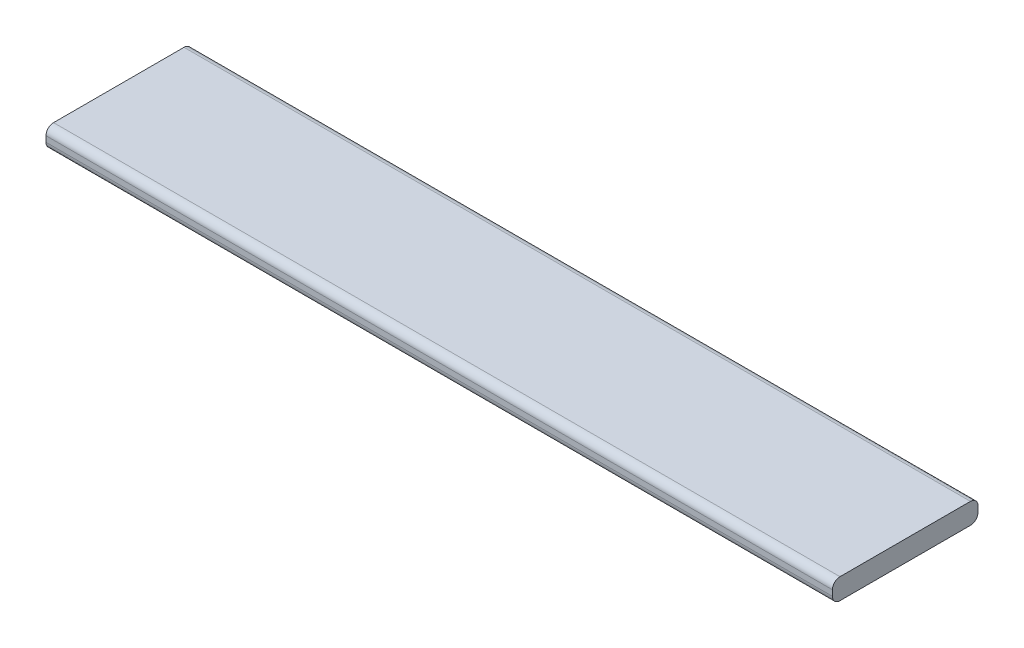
ISO-10303-21;
HEADER;
FILE_DESCRIPTION(('STEP AP214'),'2;1');
FILE_NAME('part.step','',(''),(''),'','','');
FILE_SCHEMA(('AUTOMOTIVE_DESIGN { 1 0 10303 214 1 1 1 1 }'));
ENDSEC;
DATA;
#1=APPLICATION_CONTEXT('core data for automotive mechanical design processes');
#2=APPLICATION_PROTOCOL_DEFINITION('international standard','automotive_design',2000,#1);
#3=PRODUCT_CONTEXT('',#1,'mechanical');
#4=PRODUCT('Part','Part','',(#3));
#5=PRODUCT_RELATED_PRODUCT_CATEGORY('part','',(#4));
#6=PRODUCT_DEFINITION_FORMATION('','',#4);
#7=PRODUCT_DEFINITION_CONTEXT('part definition',#1,'design');
#8=PRODUCT_DEFINITION('design','',#6,#7);
#9=PRODUCT_DEFINITION_SHAPE('','',#8);
#10=(LENGTH_UNIT() NAMED_UNIT(*) SI_UNIT(.MILLI.,.METRE.));
#11=(NAMED_UNIT(*) PLANE_ANGLE_UNIT() SI_UNIT($,.RADIAN.));
#12=(NAMED_UNIT(*) SI_UNIT($,.STERADIAN.) SOLID_ANGLE_UNIT());
#13=UNCERTAINTY_MEASURE_WITH_UNIT(LENGTH_MEASURE(1.E-05),#10,'distance_accuracy_value','');
#14=(GEOMETRIC_REPRESENTATION_CONTEXT(3) GLOBAL_UNCERTAINTY_ASSIGNED_CONTEXT((#13)) GLOBAL_UNIT_ASSIGNED_CONTEXT((#10,
#11,#12)) REPRESENTATION_CONTEXT('',''));
#15=CARTESIAN_POINT('',(0.,0.,0.));
#16=DIRECTION('',(0.,0.,1.));
#17=DIRECTION('',(1.,0.,0.));
#18=AXIS2_PLACEMENT_3D('',#15,#16,#17);
#19=CARTESIAN_POINT('',(783.878521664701,0.,0.));
#20=DIRECTION('',(0.,0.,1.));
#21=DIRECTION('',(1.,0.,0.));
#22=AXIS2_PLACEMENT_3D('',#19,#20,#21);
#23=PLANE('',#22);
#24=DIRECTION('',(0.,1.,0.));
#25=VECTOR('',#24,1.);
#26=CARTESIAN_POINT('',(0.,0.,0.));
#27=LINE('',#26,#25);
#28=CARTESIAN_POINT('',(0.,6.35,0.));
#29=VERTEX_POINT('',#28);
#30=CARTESIAN_POINT('',(0.,11.1125,0.));
#31=VERTEX_POINT('',#30);
#32=EDGE_CURVE('E175',#29,#31,#27,.T.);
#33=ORIENTED_EDGE('',*,*,#32,.T.);
#34=DIRECTION('',(-1.,0.,0.));
#35=VECTOR('',#34,1.);
#36=CARTESIAN_POINT('',(783.878521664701,11.1125,0.));
#37=LINE('',#36,#35);
#38=CARTESIAN_POINT('',(660.4,11.1125,0.));
#39=VERTEX_POINT('',#38);
#40=EDGE_CURVE('E56',#31,#39,#37,.F.);
#41=ORIENTED_EDGE('',*,*,#40,.T.);
#42=DIRECTION('',(0.,1.,0.));
#43=VECTOR('',#42,1.);
#44=CARTESIAN_POINT('',(660.4,0.,0.));
#45=LINE('',#44,#43);
#46=CARTESIAN_POINT('',(660.4,6.35,0.));
#47=VERTEX_POINT('',#46);
#48=EDGE_CURVE('E169',#47,#39,#45,.T.);
#49=ORIENTED_EDGE('',*,*,#48,.F.);
#50=DIRECTION('',(-1.,0.,0.));
#51=VECTOR('',#50,1.);
#52=CARTESIAN_POINT('',(783.878521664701,6.35,0.));
#53=LINE('',#52,#51);
#54=EDGE_CURVE('E117',#47,#29,#53,.T.);
#55=ORIENTED_EDGE('',*,*,#54,.T.);
#56=EDGE_LOOP('',(#33,#41,#49,#55));
#57=FACE_BOUND('',#56,.T.);
#58=ADVANCED_FACE('F41',(#57),#23,.F.);
#59=CARTESIAN_POINT('',(783.878521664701,17.4625,0.));
#60=DIRECTION('',(0.,-1.,0.));
#61=DIRECTION('',(0.,0.,-1.));
#62=AXIS2_PLACEMENT_3D('',#59,#60,#61);
#63=PLANE('',#62);
#64=DIRECTION('',(0.,0.,1.));
#65=VECTOR('',#64,1.);
#66=CARTESIAN_POINT('',(0.,17.4625,0.));
#67=LINE('',#66,#65);
#68=CARTESIAN_POINT('',(0.,17.4625,6.35));
#69=VERTEX_POINT('',#68);
#70=CARTESIAN_POINT('',(0.,17.4625,115.8875));
#71=VERTEX_POINT('',#70);
#72=EDGE_CURVE('E170',#69,#71,#67,.T.);
#73=ORIENTED_EDGE('',*,*,#72,.T.);
#74=DIRECTION('',(-1.,0.,0.));
#75=VECTOR('',#74,1.);
#76=CARTESIAN_POINT('',(783.878521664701,17.4625,115.8875));
#77=LINE('',#76,#75);
#78=CARTESIAN_POINT('',(660.4,17.4625,115.8875));
#79=VERTEX_POINT('',#78);
#80=EDGE_CURVE('E145',#71,#79,#77,.F.);
#81=ORIENTED_EDGE('',*,*,#80,.T.);
#82=DIRECTION('',(0.,0.,1.));
#83=VECTOR('',#82,1.);
#84=CARTESIAN_POINT('',(660.4,17.4625,0.));
#85=LINE('',#84,#83);
#86=CARTESIAN_POINT('',(660.4,17.4625,6.35));
#87=VERTEX_POINT('',#86);
#88=EDGE_CURVE('E113',#87,#79,#85,.T.);
#89=ORIENTED_EDGE('',*,*,#88,.F.);
#90=DIRECTION('',(-1.,0.,0.));
#91=VECTOR('',#90,1.);
#92=CARTESIAN_POINT('',(783.878521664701,17.4625,6.35));
#93=LINE('',#92,#91);
#94=EDGE_CURVE('E142',#87,#69,#93,.T.);
#95=ORIENTED_EDGE('',*,*,#94,.T.);
#96=EDGE_LOOP('',(#73,#81,#89,#95));
#97=FACE_BOUND('',#96,.T.);
#98=ADVANCED_FACE('F185',(#97),#63,.F.);
#99=CARTESIAN_POINT('',(783.878521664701,0.,122.2375));
#100=DIRECTION('',(0.,0.,-1.));
#101=DIRECTION('',(-1.,0.,0.));
#102=AXIS2_PLACEMENT_3D('',#99,#100,#101);
#103=PLANE('',#102);
#104=DIRECTION('',(0.,-1.,0.));
#105=VECTOR('',#104,1.);
#106=CARTESIAN_POINT('',(660.4,0.,122.2375));
#107=LINE('',#106,#105);
#108=CARTESIAN_POINT('',(660.4,11.1125,122.2375));
#109=VERTEX_POINT('',#108);
#110=CARTESIAN_POINT('',(660.4,6.34999999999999,122.2375));
#111=VERTEX_POINT('',#110);
#112=EDGE_CURVE('E110',#109,#111,#107,.T.);
#113=ORIENTED_EDGE('',*,*,#112,.F.);
#114=DIRECTION('',(-1.,0.,0.));
#115=VECTOR('',#114,1.);
#116=CARTESIAN_POINT('',(783.878521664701,11.1125,122.2375));
#117=LINE('',#116,#115);
#118=CARTESIAN_POINT('',(0.,11.1125,122.2375));
#119=VERTEX_POINT('',#118);
#120=EDGE_CURVE('E124',#109,#119,#117,.T.);
#121=ORIENTED_EDGE('',*,*,#120,.T.);
#122=DIRECTION('',(0.,-1.,0.));
#123=VECTOR('',#122,1.);
#124=CARTESIAN_POINT('',(0.,0.,122.2375));
#125=LINE('',#124,#123);
#126=CARTESIAN_POINT('',(0.,6.34999999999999,122.2375));
#127=VERTEX_POINT('',#126);
#128=EDGE_CURVE('E167',#119,#127,#125,.T.);
#129=ORIENTED_EDGE('',*,*,#128,.T.);
#130=DIRECTION('',(-1.,0.,0.));
#131=VECTOR('',#130,1.);
#132=CARTESIAN_POINT('',(783.878521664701,6.34999999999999,122.2375));
#133=LINE('',#132,#131);
#134=EDGE_CURVE('E127',#127,#111,#133,.F.);
#135=ORIENTED_EDGE('',*,*,#134,.T.);
#136=EDGE_LOOP('',(#113,#121,#129,#135));
#137=FACE_BOUND('',#136,.T.);
#138=ADVANCED_FACE('F122',(#137),#103,.F.);
#139=CARTESIAN_POINT('',(783.878521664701,0.,0.));
#140=DIRECTION('',(0.,1.,0.));
#141=DIRECTION('',(0.,0.,1.));
#142=AXIS2_PLACEMENT_3D('',#139,#140,#141);
#143=PLANE('',#142);
#144=DIRECTION('',(0.,0.,-1.));
#145=VECTOR('',#144,1.);
#146=CARTESIAN_POINT('',(0.,0.,0.));
#147=LINE('',#146,#145);
#148=CARTESIAN_POINT('',(0.,0.,115.8875));
#149=VERTEX_POINT('',#148);
#150=CARTESIAN_POINT('',(0.,0.,6.35));
#151=VERTEX_POINT('',#150);
#152=EDGE_CURVE('E160',#149,#151,#147,.T.);
#153=ORIENTED_EDGE('',*,*,#152,.T.);
#154=DIRECTION('',(-1.,0.,0.));
#155=VECTOR('',#154,1.);
#156=CARTESIAN_POINT('',(783.878521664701,0.,6.35));
#157=LINE('',#156,#155);
#158=CARTESIAN_POINT('',(660.4,0.,6.35));
#159=VERTEX_POINT('',#158);
#160=EDGE_CURVE('E11',#151,#159,#157,.F.);
#161=ORIENTED_EDGE('',*,*,#160,.T.);
#162=DIRECTION('',(0.,0.,-1.));
#163=VECTOR('',#162,1.);
#164=CARTESIAN_POINT('',(660.4,0.,0.));
#165=LINE('',#164,#163);
#166=CARTESIAN_POINT('',(660.4,0.,115.8875));
#167=VERTEX_POINT('',#166);
#168=EDGE_CURVE('E162',#167,#159,#165,.T.);
#169=ORIENTED_EDGE('',*,*,#168,.F.);
#170=DIRECTION('',(-1.,0.,0.));
#171=VECTOR('',#170,1.);
#172=CARTESIAN_POINT('',(783.878521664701,0.,115.8875));
#173=LINE('',#172,#171);
#174=EDGE_CURVE('E49',#167,#149,#173,.T.);
#175=ORIENTED_EDGE('',*,*,#174,.T.);
#176=EDGE_LOOP('',(#153,#161,#169,#175));
#177=FACE_BOUND('',#176,.T.);
#178=ADVANCED_FACE('F159',(#177),#143,.F.);
#179=CARTESIAN_POINT('',(0.,0.,0.));
#180=DIRECTION('',(1.,0.,0.));
#181=DIRECTION('',(0.,0.,-1.));
#182=AXIS2_PLACEMENT_3D('',#179,#180,#181);
#183=PLANE('',#182);
#184=ORIENTED_EDGE('',*,*,#128,.F.);
#185=CARTESIAN_POINT('',(0.,11.1125,115.8875));
#186=DIRECTION('',(1.,0.,0.));
#187=DIRECTION('',(0.,0.,-1.));
#188=AXIS2_PLACEMENT_3D('',#185,#186,#187);
#189=CIRCLE('',#188,6.35);
#190=EDGE_CURVE('E130',#119,#71,#189,.F.);
#191=ORIENTED_EDGE('',*,*,#190,.T.);
#192=ORIENTED_EDGE('',*,*,#72,.F.);
#193=CARTESIAN_POINT('',(0.,11.1125,6.35));
#194=DIRECTION('',(1.,0.,0.));
#195=DIRECTION('',(0.,0.,-1.));
#196=AXIS2_PLACEMENT_3D('',#193,#194,#195);
#197=CIRCLE('',#196,6.35);
#198=EDGE_CURVE('E139',#69,#31,#197,.F.);
#199=ORIENTED_EDGE('',*,*,#198,.T.);
#200=ORIENTED_EDGE('',*,*,#32,.F.);
#201=CARTESIAN_POINT('',(0.,6.35,6.35));
#202=DIRECTION('',(1.,0.,0.));
#203=DIRECTION('',(0.,0.,-1.));
#204=AXIS2_PLACEMENT_3D('',#201,#202,#203);
#205=CIRCLE('',#204,6.35);
#206=EDGE_CURVE('E133',#29,#151,#205,.F.);
#207=ORIENTED_EDGE('',*,*,#206,.T.);
#208=ORIENTED_EDGE('',*,*,#152,.F.);
#209=CARTESIAN_POINT('',(0.,6.34999999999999,115.8875));
#210=DIRECTION('',(1.,0.,0.));
#211=DIRECTION('',(0.,0.,-1.));
#212=AXIS2_PLACEMENT_3D('',#209,#210,#211);
#213=CIRCLE('',#212,6.35);
#214=EDGE_CURVE('E131',#149,#127,#213,.F.);
#215=ORIENTED_EDGE('',*,*,#214,.T.);
#216=EDGE_LOOP('',(#184,#191,#192,#199,#200,#207,#208,#215));
#217=FACE_BOUND('',#216,.T.);
#218=ADVANCED_FACE('F165',(#217),#183,.F.);
#219=CARTESIAN_POINT('',(660.4,0.,0.));
#220=DIRECTION('',(1.,0.,0.));
#221=DIRECTION('',(0.,0.,-1.));
#222=AXIS2_PLACEMENT_3D('',#219,#220,#221);
#223=PLANE('',#222);
#224=ORIENTED_EDGE('',*,*,#88,.T.);
#225=CARTESIAN_POINT('',(660.4,11.1125,115.8875));
#226=DIRECTION('',(1.,0.,0.));
#227=DIRECTION('',(0.,0.,-1.));
#228=AXIS2_PLACEMENT_3D('',#225,#226,#227);
#229=CIRCLE('',#228,6.35);
#230=EDGE_CURVE('E107',#79,#109,#229,.T.);
#231=ORIENTED_EDGE('',*,*,#230,.T.);
#232=ORIENTED_EDGE('',*,*,#112,.T.);
#233=CARTESIAN_POINT('',(660.4,6.34999999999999,115.8875));
#234=DIRECTION('',(1.,0.,0.));
#235=DIRECTION('',(0.,0.,-1.));
#236=AXIS2_PLACEMENT_3D('',#233,#234,#235);
#237=CIRCLE('',#236,6.35);
#238=EDGE_CURVE('E147',#111,#167,#237,.T.);
#239=ORIENTED_EDGE('',*,*,#238,.T.);
#240=ORIENTED_EDGE('',*,*,#168,.T.);
#241=CARTESIAN_POINT('',(660.4,6.35,6.35));
#242=DIRECTION('',(1.,0.,0.));
#243=DIRECTION('',(0.,0.,-1.));
#244=AXIS2_PLACEMENT_3D('',#241,#242,#243);
#245=CIRCLE('',#244,6.35);
#246=EDGE_CURVE('E63',#159,#47,#245,.T.);
#247=ORIENTED_EDGE('',*,*,#246,.T.);
#248=ORIENTED_EDGE('',*,*,#48,.T.);
#249=CARTESIAN_POINT('',(660.4,11.1125,6.35));
#250=DIRECTION('',(1.,0.,0.));
#251=DIRECTION('',(0.,0.,-1.));
#252=AXIS2_PLACEMENT_3D('',#249,#250,#251);
#253=CIRCLE('',#252,6.35);
#254=EDGE_CURVE('E118',#39,#87,#253,.T.);
#255=ORIENTED_EDGE('',*,*,#254,.T.);
#256=EDGE_LOOP('',(#224,#231,#232,#239,#240,#247,#248,#255));
#257=FACE_BOUND('',#256,.T.);
#258=ADVANCED_FACE('F109',(#257),#223,.T.);
#259=CARTESIAN_POINT('',(783.878521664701,11.1125,115.8875));
#260=DIRECTION('',(-1.,0.,0.));
#261=DIRECTION('',(0.,0.,1.));
#262=AXIS2_PLACEMENT_3D('',#259,#260,#261);
#263=CYLINDRICAL_SURFACE('',#262,6.35);
#264=ORIENTED_EDGE('',*,*,#230,.F.);
#265=ORIENTED_EDGE('',*,*,#80,.F.);
#266=ORIENTED_EDGE('',*,*,#190,.F.);
#267=ORIENTED_EDGE('',*,*,#120,.F.);
#268=EDGE_LOOP('',(#264,#265,#266,#267));
#269=FACE_BOUND('',#268,.T.);
#270=ADVANCED_FACE('F129',(#269),#263,.T.);
#271=CARTESIAN_POINT('',(783.878521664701,11.1125,6.35));
#272=DIRECTION('',(-1.,0.,0.));
#273=DIRECTION('',(0.,0.,1.));
#274=AXIS2_PLACEMENT_3D('',#271,#272,#273);
#275=CYLINDRICAL_SURFACE('',#274,6.35);
#276=ORIENTED_EDGE('',*,*,#254,.F.);
#277=ORIENTED_EDGE('',*,*,#40,.F.);
#278=ORIENTED_EDGE('',*,*,#198,.F.);
#279=ORIENTED_EDGE('',*,*,#94,.F.);
#280=EDGE_LOOP('',(#276,#277,#278,#279));
#281=FACE_BOUND('',#280,.T.);
#282=ADVANCED_FACE('F182',(#281),#275,.T.);
#283=CARTESIAN_POINT('',(783.878521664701,6.35,6.35));
#284=DIRECTION('',(-1.,0.,0.));
#285=DIRECTION('',(0.,0.,1.));
#286=AXIS2_PLACEMENT_3D('',#283,#284,#285);
#287=CYLINDRICAL_SURFACE('',#286,6.35);
#288=ORIENTED_EDGE('',*,*,#246,.F.);
#289=ORIENTED_EDGE('',*,*,#160,.F.);
#290=ORIENTED_EDGE('',*,*,#206,.F.);
#291=ORIENTED_EDGE('',*,*,#54,.F.);
#292=EDGE_LOOP('',(#288,#289,#290,#291));
#293=FACE_BOUND('',#292,.T.);
#294=ADVANCED_FACE('F187',(#293),#287,.T.);
#295=CARTESIAN_POINT('',(783.878521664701,6.34999999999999,115.8875));
#296=DIRECTION('',(-1.,0.,0.));
#297=DIRECTION('',(0.,0.,1.));
#298=AXIS2_PLACEMENT_3D('',#295,#296,#297);
#299=CYLINDRICAL_SURFACE('',#298,6.35);
#300=ORIENTED_EDGE('',*,*,#238,.F.);
#301=ORIENTED_EDGE('',*,*,#134,.F.);
#302=ORIENTED_EDGE('',*,*,#214,.F.);
#303=ORIENTED_EDGE('',*,*,#174,.F.);
#304=EDGE_LOOP('',(#300,#301,#302,#303));
#305=FACE_BOUND('',#304,.T.);
#306=ADVANCED_FACE('F43',(#305),#299,.T.);
#307=CLOSED_SHELL('',(#58,#98,#138,#178,#218,#258,#270,#282,#294,#306));
#308=MANIFOLD_SOLID_BREP('B2',#307);
#309=ADVANCED_BREP_SHAPE_REPRESENTATION('',(#18,#308),#14);
#310=SHAPE_DEFINITION_REPRESENTATION(#9,#309);
ENDSEC;
END-ISO-10303-21;
